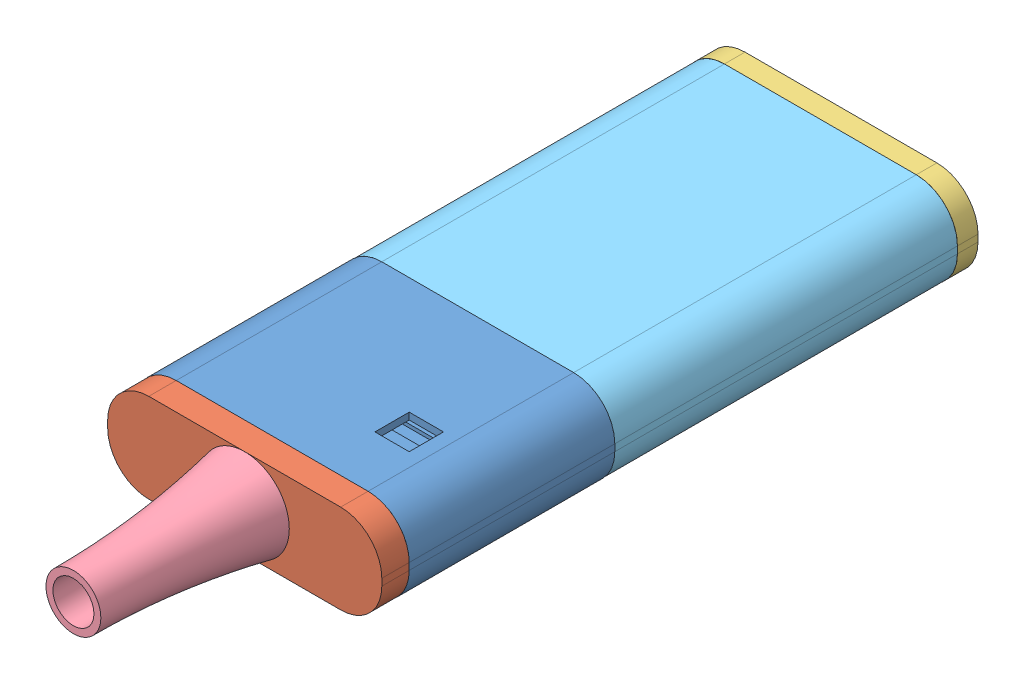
SolidWorks assembly stylet.SLDASM, configuration Défaut (file format 9000). Lengths in mm.
Overall size (40 13 112).
5 component instances, 5 part files, 9 mates.
Components (placement in the parent):
- tube-1: tube.SLDPRT [Défaut] at (25.438 -5.2604 50) size (40 13 30)
- devant-1: devant.SLDPRT [Défaut] at (24.2835 -6.2604 80) size (40 13 4)
- fond-1: fond.SLDPRT [Défaut] at (28.5168 -6.2604 -3) size (40 13 3)
- led-1: led.SLDPRT [Défaut] at (-5.68 3.2396 90.6289) x (0 0 -1) z (1 0 0) size (25 13 13)
- trou-1: trou.SLDPRT [Défaut] at (4.136 -5.2604 0) size (40 13 50)
Mates (geometry in assembly coordinates):
- Coïncidente2: coincident aligned: line of tube-1 through (8.32 6.7396 80) axis (-1 0 0); line of devant-1 through (8.32 6.7396 80) axis (-1 0 0)
- Coïncidente3: coincident aligned: line of tube-1 through (14.32 -0.2604 80) axis (0 1 0); line of devant-1 through (14.32 -0.2604 80) axis (0 1 0)
- Coïncidente8: coincident anti-aligned: plane of tube-1 through (-19.68 -0.2604 50) normal (0 0 -1); plane of trou-1 through (-19.68 -0.2604 50) normal (0 0 1)
- Coïncidente9: coincident aligned: line of tube-1 through (8.32 6.7396 50) axis (-1 0 0); line of trou-1 through (8.32 6.7396 50) axis (-1 0 0)
- Coïncidente10: coincident aligned: line of tube-1 through (-25.68 0.7396 50) axis (0 -1 0); line of trou-1 through (-25.68 0.7396 50) axis (0 -1 0)
- Coaxiale2: concentric aligned: circle of devant-1; circle of led-1
- Coïncidente7: coincident anti-aligned: plane of devant-1 through (-19.68 -0.2604 84) normal (0 0 1); plane of led-1 through (-5.68 3.2396 84) normal (0 0 -1)
- Coïncidente11: coincident aligned: line of fond-1 through (28 8.32 6.7396) axis (0 -1 0); line of trou-1 through (28 8.32 6.7396) axis (0 -1 0)
- Coïncidente20: coincident aligned: line of fond-1 through (1 -25.68 0.7396) axis (0 0 -1); line of trou-1 through (1 -25.68 0.7396) axis (0 0 -1)
